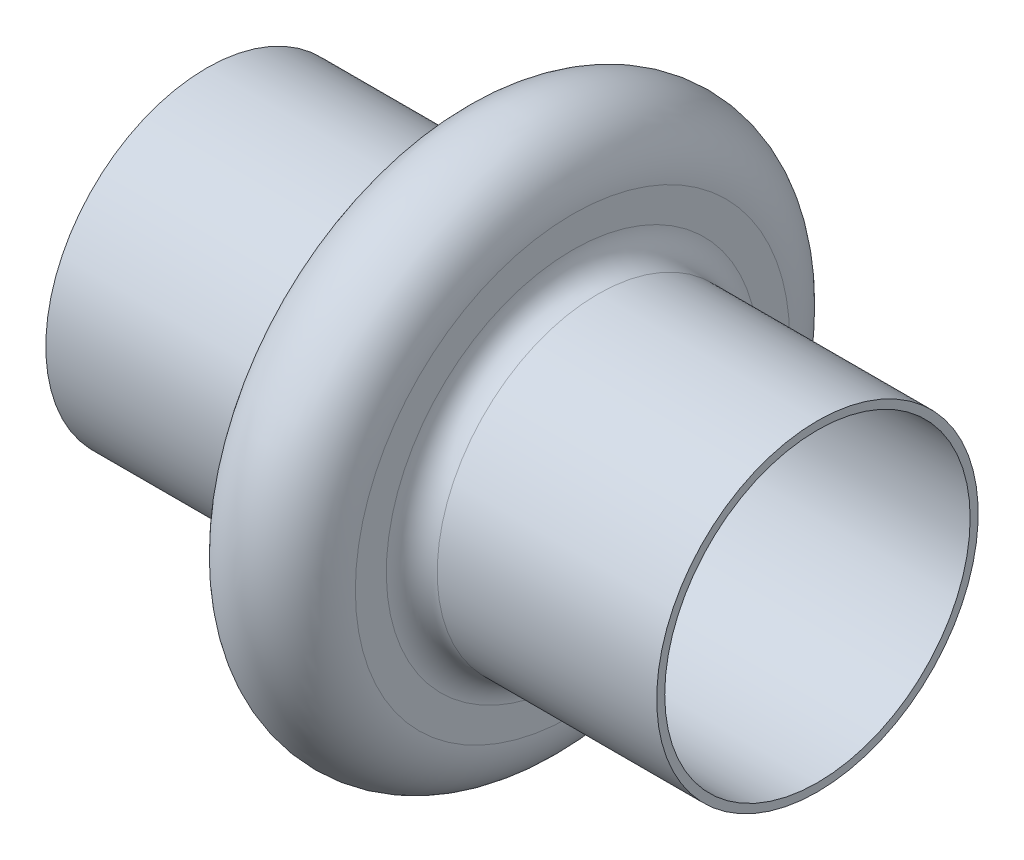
ISO-10303-21;
HEADER;
FILE_DESCRIPTION(('STEP AP214'),'2;1');
FILE_NAME('part.step','',(''),(''),'','','');
FILE_SCHEMA(('AUTOMOTIVE_DESIGN { 1 0 10303 214 1 1 1 1 }'));
ENDSEC;
DATA;
#1=APPLICATION_CONTEXT('core data for automotive mechanical design processes');
#2=APPLICATION_PROTOCOL_DEFINITION('international standard','automotive_design',2000,#1);
#3=PRODUCT_CONTEXT('',#1,'mechanical');
#4=PRODUCT('Part','Part','',(#3));
#5=PRODUCT_RELATED_PRODUCT_CATEGORY('part','',(#4));
#6=PRODUCT_DEFINITION_FORMATION('','',#4);
#7=PRODUCT_DEFINITION_CONTEXT('part definition',#1,'design');
#8=PRODUCT_DEFINITION('design','',#6,#7);
#9=PRODUCT_DEFINITION_SHAPE('','',#8);
#10=(LENGTH_UNIT() NAMED_UNIT(*) SI_UNIT(.MILLI.,.METRE.));
#11=(NAMED_UNIT(*) PLANE_ANGLE_UNIT() SI_UNIT($,.RADIAN.));
#12=(NAMED_UNIT(*) SI_UNIT($,.STERADIAN.) SOLID_ANGLE_UNIT());
#13=UNCERTAINTY_MEASURE_WITH_UNIT(LENGTH_MEASURE(1.E-05),#10,'distance_accuracy_value','');
#14=(GEOMETRIC_REPRESENTATION_CONTEXT(3) GLOBAL_UNCERTAINTY_ASSIGNED_CONTEXT((#13)) GLOBAL_UNIT_ASSIGNED_CONTEXT((#10,
#11,#12)) REPRESENTATION_CONTEXT('',''));
#15=CARTESIAN_POINT('',(0.,0.,0.));
#16=DIRECTION('',(0.,0.,1.));
#17=DIRECTION('',(1.,0.,0.));
#18=AXIS2_PLACEMENT_3D('',#15,#16,#17);
#19=CARTESIAN_POINT('',(0.,8.2105,0.));
#20=DIRECTION('',(-1.,0.,0.));
#21=DIRECTION('',(0.,0.,1.));
#22=AXIS2_PLACEMENT_3D('',#19,#20,#21);
#23=PLANE('',#22);
#24=CARTESIAN_POINT('',(0.,0.,0.));
#25=DIRECTION('',(-1.,0.,0.));
#26=DIRECTION('',(0.,1.,0.));
#27=AXIS2_PLACEMENT_3D('',#24,#25,#26);
#28=CIRCLE('',#27,8.);
#29=CARTESIAN_POINT('',(0.,8.,0.));
#30=VERTEX_POINT('',#29);
#31=EDGE_CURVE('E41',#30,#30,#28,.T.);
#32=ORIENTED_EDGE('',*,*,#31,.F.);
#33=EDGE_LOOP('',(#32));
#34=FACE_BOUND('',#33,.T.);
#35=CARTESIAN_POINT('',(0.,0.,0.));
#36=DIRECTION('',(-1.,0.,0.));
#37=DIRECTION('',(0.,1.,0.));
#38=AXIS2_PLACEMENT_3D('',#35,#36,#37);
#39=CIRCLE('',#38,8.421);
#40=CARTESIAN_POINT('',(0.,8.421,0.));
#41=VERTEX_POINT('',#40);
#42=EDGE_CURVE('E8',#41,#41,#39,.T.);
#43=ORIENTED_EDGE('',*,*,#42,.T.);
#44=EDGE_LOOP('',(#43));
#45=FACE_BOUND('',#44,.T.);
#46=ADVANCED_FACE('F13',(#34,#45),#23,.T.);
#47=CARTESIAN_POINT('',(12.83,10.56475,0.));
#48=DIRECTION('',(-1.,0.,0.));
#49=DIRECTION('',(0.,-1.,0.));
#50=AXIS2_PLACEMENT_3D('',#47,#48,#49);
#51=PLANE('',#50);
#52=CARTESIAN_POINT('',(12.83,0.,0.));
#53=DIRECTION('',(-1.,0.,0.));
#54=DIRECTION('',(0.,1.,0.));
#55=AXIS2_PLACEMENT_3D('',#52,#53,#54);
#56=CIRCLE('',#55,9.754);
#57=CARTESIAN_POINT('',(12.83,9.754,0.));
#58=VERTEX_POINT('',#57);
#59=EDGE_CURVE('E43',#58,#58,#56,.T.);
#60=ORIENTED_EDGE('',*,*,#59,.F.);
#61=EDGE_LOOP('',(#60));
#62=FACE_BOUND('',#61,.T.);
#63=CARTESIAN_POINT('',(12.83,0.,0.));
#64=DIRECTION('',(-1.,0.,0.));
#65=DIRECTION('',(0.,1.,0.));
#66=AXIS2_PLACEMENT_3D('',#63,#64,#65);
#67=CIRCLE('',#66,11.3755);
#68=CARTESIAN_POINT('',(12.83,11.3755,0.));
#69=VERTEX_POINT('',#68);
#70=EDGE_CURVE('E21',#69,#69,#67,.T.);
#71=ORIENTED_EDGE('',*,*,#70,.T.);
#72=EDGE_LOOP('',(#71));
#73=FACE_BOUND('',#72,.T.);
#74=ADVANCED_FACE('F78',(#62,#73),#51,.T.);
#75=CARTESIAN_POINT('',(19.17,10.56475,0.));
#76=DIRECTION('',(1.,0.,0.));
#77=DIRECTION('',(0.,0.,-1.));
#78=AXIS2_PLACEMENT_3D('',#75,#76,#77);
#79=PLANE('',#78);
#80=CARTESIAN_POINT('',(19.17,0.,0.));
#81=DIRECTION('',(-1.,0.,0.));
#82=DIRECTION('',(0.,1.,0.));
#83=AXIS2_PLACEMENT_3D('',#80,#81,#82);
#84=CIRCLE('',#83,9.754);
#85=CARTESIAN_POINT('',(19.17,9.754,0.));
#86=VERTEX_POINT('',#85);
#87=EDGE_CURVE('E26',#86,#86,#84,.T.);
#88=ORIENTED_EDGE('',*,*,#87,.T.);
#89=EDGE_LOOP('',(#88));
#90=FACE_BOUND('',#89,.T.);
#91=CARTESIAN_POINT('',(19.17,0.,0.));
#92=DIRECTION('',(-1.,0.,0.));
#93=DIRECTION('',(0.,1.,0.));
#94=AXIS2_PLACEMENT_3D('',#91,#92,#93);
#95=CIRCLE('',#94,11.3755);
#96=CARTESIAN_POINT('',(19.17,11.3755,0.));
#97=VERTEX_POINT('',#96);
#98=EDGE_CURVE('E44',#97,#97,#95,.T.);
#99=ORIENTED_EDGE('',*,*,#98,.F.);
#100=EDGE_LOOP('',(#99));
#101=FACE_BOUND('',#100,.T.);
#102=ADVANCED_FACE('F84',(#90,#101),#79,.T.);
#103=CARTESIAN_POINT('',(32.,8.2105,0.));
#104=DIRECTION('',(1.,0.,0.));
#105=DIRECTION('',(0.,0.,-1.));
#106=AXIS2_PLACEMENT_3D('',#103,#104,#105);
#107=PLANE('',#106);
#108=CARTESIAN_POINT('',(32.,0.,0.));
#109=DIRECTION('',(-1.,0.,0.));
#110=DIRECTION('',(0.,1.,0.));
#111=AXIS2_PLACEMENT_3D('',#108,#109,#110);
#112=CIRCLE('',#111,8.);
#113=CARTESIAN_POINT('',(32.,8.,0.));
#114=VERTEX_POINT('',#113);
#115=EDGE_CURVE('E32',#114,#114,#112,.T.);
#116=ORIENTED_EDGE('',*,*,#115,.T.);
#117=EDGE_LOOP('',(#116));
#118=FACE_BOUND('',#117,.T.);
#119=CARTESIAN_POINT('',(32.,0.,0.));
#120=DIRECTION('',(-1.,0.,0.));
#121=DIRECTION('',(0.,1.,0.));
#122=AXIS2_PLACEMENT_3D('',#119,#120,#121);
#123=CIRCLE('',#122,8.421);
#124=CARTESIAN_POINT('',(32.,8.421,0.));
#125=VERTEX_POINT('',#124);
#126=EDGE_CURVE('E36',#125,#125,#123,.T.);
#127=ORIENTED_EDGE('',*,*,#126,.F.);
#128=EDGE_LOOP('',(#127));
#129=FACE_BOUND('',#128,.T.);
#130=ADVANCED_FACE('F90',(#118,#129),#107,.T.);
#131=CARTESIAN_POINT('',(26.2515,0.,0.));
#132=DIRECTION('',(-1.,0.,0.));
#133=DIRECTION('',(0.,0.,1.));
#134=AXIS2_PLACEMENT_3D('',#131,#132,#133);
#135=CYLINDRICAL_SURFACE('',#134,8.421);
#136=CARTESIAN_POINT('',(20.503,0.,0.));
#137=DIRECTION('',(-1.,0.,0.));
#138=DIRECTION('',(0.,1.,0.));
#139=AXIS2_PLACEMENT_3D('',#136,#137,#138);
#140=CIRCLE('',#139,8.421);
#141=CARTESIAN_POINT('',(20.503,8.421,0.));
#142=VERTEX_POINT('',#141);
#143=EDGE_CURVE('E35',#142,#142,#140,.T.);
#144=ORIENTED_EDGE('',*,*,#143,.F.);
#145=EDGE_LOOP('',(#144));
#146=FACE_BOUND('',#145,.T.);
#147=ORIENTED_EDGE('',*,*,#126,.T.);
#148=EDGE_LOOP('',(#147));
#149=FACE_BOUND('',#148,.T.);
#150=ADVANCED_FACE('F57',(#146,#149),#135,.T.);
#151=CARTESIAN_POINT('',(20.503,0.,0.));
#152=DIRECTION('',(-1.,0.,0.));
#153=DIRECTION('',(0.,0.,1.));
#154=AXIS2_PLACEMENT_3D('',#151,#152,#153);
#155=TOROIDAL_SURFACE('',#154,9.75399999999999,1.33299999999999);
#156=ORIENTED_EDGE('',*,*,#143,.T.);
#157=EDGE_LOOP('',(#156));
#158=FACE_BOUND('',#157,.T.);
#159=ORIENTED_EDGE('',*,*,#87,.F.);
#160=EDGE_LOOP('',(#159));
#161=FACE_BOUND('',#160,.T.);
#162=ADVANCED_FACE('F52',(#158,#161),#155,.F.);
#163=CARTESIAN_POINT('',(11.497,0.,0.));
#164=DIRECTION('',(-1.,0.,0.));
#165=DIRECTION('',(0.,0.,1.));
#166=AXIS2_PLACEMENT_3D('',#163,#164,#165);
#167=TOROIDAL_SURFACE('',#166,9.754,1.333);
#168=ORIENTED_EDGE('',*,*,#59,.T.);
#169=EDGE_LOOP('',(#168));
#170=FACE_BOUND('',#169,.T.);
#171=CARTESIAN_POINT('',(11.497,0.,0.));
#172=DIRECTION('',(-1.,0.,0.));
#173=DIRECTION('',(0.,1.,0.));
#174=AXIS2_PLACEMENT_3D('',#171,#172,#173);
#175=CIRCLE('',#174,8.421);
#176=CARTESIAN_POINT('',(11.497,8.421,0.));
#177=VERTEX_POINT('',#176);
#178=EDGE_CURVE('E30',#177,#177,#175,.T.);
#179=ORIENTED_EDGE('',*,*,#178,.F.);
#180=EDGE_LOOP('',(#179));
#181=FACE_BOUND('',#180,.T.);
#182=ADVANCED_FACE('F56',(#170,#181),#167,.F.);
#183=CARTESIAN_POINT('',(5.7485,0.,0.));
#184=DIRECTION('',(-1.,0.,0.));
#185=DIRECTION('',(0.,0.,1.));
#186=AXIS2_PLACEMENT_3D('',#183,#184,#185);
#187=CYLINDRICAL_SURFACE('',#186,8.421);
#188=ORIENTED_EDGE('',*,*,#42,.F.);
#189=EDGE_LOOP('',(#188));
#190=FACE_BOUND('',#189,.T.);
#191=ORIENTED_EDGE('',*,*,#178,.T.);
#192=EDGE_LOOP('',(#191));
#193=FACE_BOUND('',#192,.T.);
#194=ADVANCED_FACE('F62',(#190,#193),#187,.T.);
#195=CARTESIAN_POINT('',(16.,0.,0.));
#196=DIRECTION('',(1.,0.,0.));
#197=DIRECTION('',(0.,1.,0.));
#198=AXIS2_PLACEMENT_3D('',#195,#196,#197);
#199=CIRCLE('',#198,8.);
#200=DIRECTION('',(-1.,0.,0.));
#201=VECTOR('',#200,1.);
#202=SURFACE_OF_LINEAR_EXTRUSION('',#199,#201);
#203=ORIENTED_EDGE('',*,*,#115,.F.);
#204=EDGE_LOOP('',(#203));
#205=FACE_BOUND('',#204,.T.);
#206=ORIENTED_EDGE('',*,*,#31,.T.);
#207=EDGE_LOOP('',(#206));
#208=FACE_BOUND('',#207,.T.);
#209=ADVANCED_FACE('F65',(#205,#208),#202,.T.);
#210=CARTESIAN_POINT('',(16.,0.,0.));
#211=DIRECTION('',(-1.,0.,0.));
#212=DIRECTION('',(0.,0.,1.));
#213=AXIS2_PLACEMENT_3D('',#210,#211,#212);
#214=TOROIDAL_SURFACE('',#213,11.3755,3.17);
#215=ORIENTED_EDGE('',*,*,#98,.T.);
#216=EDGE_LOOP('',(#215));
#217=FACE_BOUND('',#216,.T.);
#218=ORIENTED_EDGE('',*,*,#70,.F.);
#219=EDGE_LOOP('',(#218));
#220=FACE_BOUND('',#219,.T.);
#221=ADVANCED_FACE('F15',(#217,#220),#214,.T.);
#222=CLOSED_SHELL('',(#46,#74,#102,#130,#150,#162,#182,#194,#209,#221));
#223=MANIFOLD_SOLID_BREP('B1',#222);
#224=ADVANCED_BREP_SHAPE_REPRESENTATION('',(#18,#223),#14);
#225=SHAPE_DEFINITION_REPRESENTATION(#9,#224);
ENDSEC;
END-ISO-10303-21;
